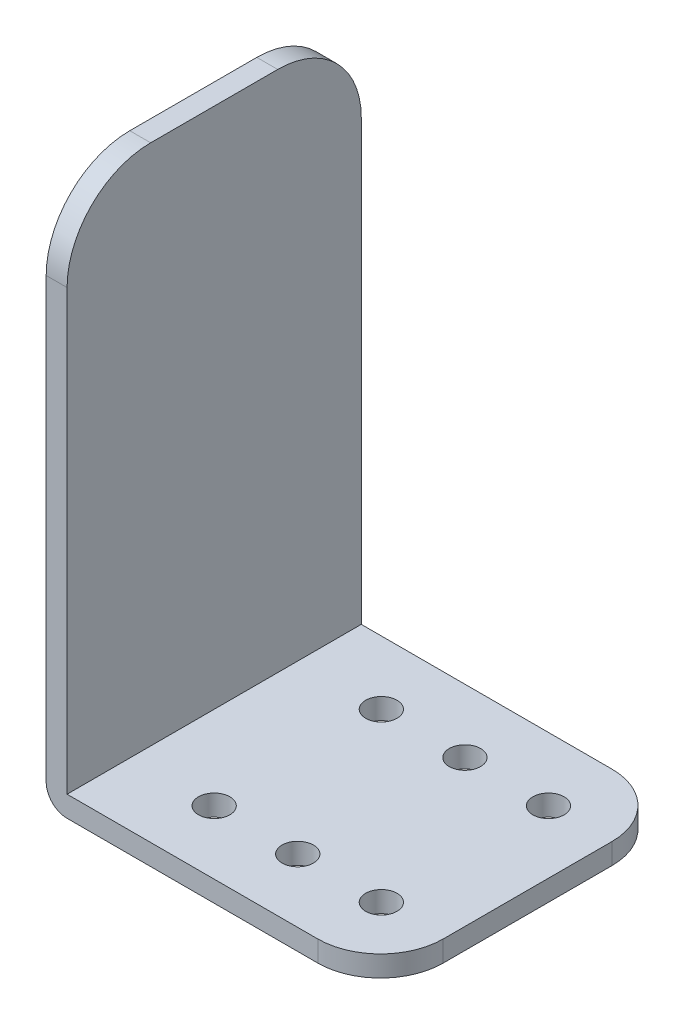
ISO-10303-21;
HEADER;
FILE_DESCRIPTION(('STEP AP214'),'2;1');
FILE_NAME('part.step','',(''),(''),'','','');
FILE_SCHEMA(('AUTOMOTIVE_DESIGN { 1 0 10303 214 1 1 1 1 }'));
ENDSEC;
DATA;
#1=APPLICATION_CONTEXT('core data for automotive mechanical design processes');
#2=APPLICATION_PROTOCOL_DEFINITION('international standard','automotive_design',2000,#1);
#3=PRODUCT_CONTEXT('',#1,'mechanical');
#4=PRODUCT('Part','Part','',(#3));
#5=PRODUCT_RELATED_PRODUCT_CATEGORY('part','',(#4));
#6=PRODUCT_DEFINITION_FORMATION('','',#4);
#7=PRODUCT_DEFINITION_CONTEXT('part definition',#1,'design');
#8=PRODUCT_DEFINITION('design','',#6,#7);
#9=PRODUCT_DEFINITION_SHAPE('','',#8);
#10=(LENGTH_UNIT() NAMED_UNIT(*) SI_UNIT(.MILLI.,.METRE.));
#11=(NAMED_UNIT(*) PLANE_ANGLE_UNIT() SI_UNIT($,.RADIAN.));
#12=(NAMED_UNIT(*) SI_UNIT($,.STERADIAN.) SOLID_ANGLE_UNIT());
#13=UNCERTAINTY_MEASURE_WITH_UNIT(LENGTH_MEASURE(1.E-05),#10,'distance_accuracy_value','');
#14=(GEOMETRIC_REPRESENTATION_CONTEXT(3) GLOBAL_UNCERTAINTY_ASSIGNED_CONTEXT((#13)) GLOBAL_UNIT_ASSIGNED_CONTEXT((#10,
#11,#12)) REPRESENTATION_CONTEXT('',''));
#15=CARTESIAN_POINT('',(0.,0.,0.));
#16=DIRECTION('',(0.,0.,1.));
#17=DIRECTION('',(1.,0.,0.));
#18=AXIS2_PLACEMENT_3D('',#15,#16,#17);
#19=CARTESIAN_POINT('',(0.,-82.55,171.45));
#20=DIRECTION('',(0.,1.,0.));
#21=DIRECTION('',(0.,0.,1.));
#22=AXIS2_PLACEMENT_3D('',#19,#20,#21);
#23=PLANE('',#22);
#24=CARTESIAN_POINT('',(41.275,-82.55,136.398));
#25=DIRECTION('',(0.,1.,0.));
#26=DIRECTION('',(0.,0.,1.));
#27=AXIS2_PLACEMENT_3D('',#24,#25,#26);
#28=CIRCLE('',#27,2.38125);
#29=CARTESIAN_POINT('',(41.275,-82.55,138.77925));
#30=VERTEX_POINT('',#29);
#31=EDGE_CURVE('E260',#30,#30,#28,.F.);
#32=ORIENTED_EDGE('',*,*,#31,.F.);
#33=EDGE_LOOP('',(#32));
#34=FACE_BOUND('',#33,.T.);
#35=CARTESIAN_POINT('',(28.575,-82.55,136.398));
#36=DIRECTION('',(0.,1.,0.));
#37=DIRECTION('',(0.,0.,1.));
#38=AXIS2_PLACEMENT_3D('',#35,#36,#37);
#39=CIRCLE('',#38,2.38125);
#40=CARTESIAN_POINT('',(28.575,-82.55,138.77925));
#41=VERTEX_POINT('',#40);
#42=EDGE_CURVE('E254',#41,#41,#39,.F.);
#43=ORIENTED_EDGE('',*,*,#42,.F.);
#44=EDGE_LOOP('',(#43));
#45=FACE_BOUND('',#44,.T.);
#46=CARTESIAN_POINT('',(15.875,-82.55,136.398));
#47=DIRECTION('',(0.,1.,0.));
#48=DIRECTION('',(0.,0.,1.));
#49=AXIS2_PLACEMENT_3D('',#46,#47,#48);
#50=CIRCLE('',#49,2.38125);
#51=CARTESIAN_POINT('',(15.875,-82.55,138.77925));
#52=VERTEX_POINT('',#51);
#53=EDGE_CURVE('E248',#52,#52,#50,.F.);
#54=ORIENTED_EDGE('',*,*,#53,.F.);
#55=EDGE_LOOP('',(#54));
#56=FACE_BOUND('',#55,.T.);
#57=CARTESIAN_POINT('',(41.275,-82.55,161.798));
#58=DIRECTION('',(0.,1.,0.));
#59=DIRECTION('',(0.,0.,1.));
#60=AXIS2_PLACEMENT_3D('',#57,#58,#59);
#61=CIRCLE('',#60,2.38125);
#62=CARTESIAN_POINT('',(41.275,-82.55,164.17925));
#63=VERTEX_POINT('',#62);
#64=EDGE_CURVE('E242',#63,#63,#61,.F.);
#65=ORIENTED_EDGE('',*,*,#64,.F.);
#66=EDGE_LOOP('',(#65));
#67=FACE_BOUND('',#66,.T.);
#68=CARTESIAN_POINT('',(28.575,-82.55,161.798));
#69=DIRECTION('',(0.,1.,0.));
#70=DIRECTION('',(0.,0.,1.));
#71=AXIS2_PLACEMENT_3D('',#68,#69,#70);
#72=CIRCLE('',#71,2.38125);
#73=CARTESIAN_POINT('',(28.575,-82.55,164.17925));
#74=VERTEX_POINT('',#73);
#75=EDGE_CURVE('E236',#74,#74,#72,.F.);
#76=ORIENTED_EDGE('',*,*,#75,.F.);
#77=EDGE_LOOP('',(#76));
#78=FACE_BOUND('',#77,.T.);
#79=CARTESIAN_POINT('',(15.875,-82.55,161.798));
#80=DIRECTION('',(0.,1.,0.));
#81=DIRECTION('',(0.,0.,1.));
#82=AXIS2_PLACEMENT_3D('',#79,#80,#81);
#83=CIRCLE('',#82,2.38125);
#84=CARTESIAN_POINT('',(15.875,-82.55,164.17925));
#85=VERTEX_POINT('',#84);
#86=EDGE_CURVE('E228',#85,#85,#83,.F.);
#87=ORIENTED_EDGE('',*,*,#86,.F.);
#88=EDGE_LOOP('',(#87));
#89=FACE_BOUND('',#88,.T.);
#90=DIRECTION('',(1.,0.,0.));
#91=VECTOR('',#90,1.);
#92=CARTESIAN_POINT('',(0.,-82.55,171.45));
#93=LINE('',#92,#91);
#94=CARTESIAN_POINT('',(3.17500000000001,-82.55,171.45));
#95=VERTEX_POINT('',#94);
#96=CARTESIAN_POINT('',(41.275,-82.55,171.45));
#97=VERTEX_POINT('',#96);
#98=EDGE_CURVE('E203',#95,#97,#93,.T.);
#99=ORIENTED_EDGE('',*,*,#98,.F.);
#100=DIRECTION('',(0.,0.,-1.));
#101=VECTOR('',#100,1.);
#102=CARTESIAN_POINT('',(3.17500000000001,-82.55,171.45));
#103=LINE('',#102,#101);
#104=CARTESIAN_POINT('',(3.17500000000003,-82.55,126.746));
#105=VERTEX_POINT('',#104);
#106=EDGE_CURVE('E172',#95,#105,#103,.T.);
#107=ORIENTED_EDGE('',*,*,#106,.T.);
#108=DIRECTION('',(-1.,0.,0.));
#109=VECTOR('',#108,1.);
#110=CARTESIAN_POINT('',(50.8,-82.55,126.746));
#111=LINE('',#110,#109);
#112=CARTESIAN_POINT('',(41.275,-82.55,126.746));
#113=VERTEX_POINT('',#112);
#114=EDGE_CURVE('E130',#113,#105,#111,.T.);
#115=ORIENTED_EDGE('',*,*,#114,.F.);
#116=CARTESIAN_POINT('',(41.275,-82.55,136.271));
#117=DIRECTION('',(0.,1.,0.));
#118=DIRECTION('',(0.,0.,1.));
#119=AXIS2_PLACEMENT_3D('',#116,#117,#118);
#120=CIRCLE('',#119,9.525);
#121=CARTESIAN_POINT('',(50.8,-82.55,136.271));
#122=VERTEX_POINT('',#121);
#123=EDGE_CURVE('E165',#113,#122,#120,.F.);
#124=ORIENTED_EDGE('',*,*,#123,.T.);
#125=DIRECTION('',(0.,0.,-1.));
#126=VECTOR('',#125,1.);
#127=CARTESIAN_POINT('',(50.8,-82.55,171.45));
#128=LINE('',#127,#126);
#129=CARTESIAN_POINT('',(50.8,-82.55,161.925));
#130=VERTEX_POINT('',#129);
#131=EDGE_CURVE('E147',#130,#122,#128,.T.);
#132=ORIENTED_EDGE('',*,*,#131,.F.);
#133=CARTESIAN_POINT('',(41.275,-82.55,161.925));
#134=DIRECTION('',(0.,1.,0.));
#135=DIRECTION('',(0.,0.,1.));
#136=AXIS2_PLACEMENT_3D('',#133,#134,#135);
#137=CIRCLE('',#136,9.525);
#138=EDGE_CURVE('E167',#130,#97,#137,.F.);
#139=ORIENTED_EDGE('',*,*,#138,.T.);
#140=EDGE_LOOP('',(#99,#107,#115,#124,#132,#139));
#141=FACE_BOUND('',#140,.T.);
#142=ADVANCED_FACE('F35',(#34,#45,#56,#67,#78,#89,#141),#23,.F.);
#143=CARTESIAN_POINT('',(50.8,-82.55,171.45));
#144=DIRECTION('',(-1.,0.,0.));
#145=DIRECTION('',(0.,0.,1.));
#146=AXIS2_PLACEMENT_3D('',#143,#144,#145);
#147=PLANE('',#146);
#148=DIRECTION('',(0.,0.,-1.));
#149=VECTOR('',#148,1.);
#150=CARTESIAN_POINT('',(50.8,-79.375,171.45));
#151=LINE('',#150,#149);
#152=CARTESIAN_POINT('',(50.8,-79.375,161.925));
#153=VERTEX_POINT('',#152);
#154=CARTESIAN_POINT('',(50.8,-79.375,136.271));
#155=VERTEX_POINT('',#154);
#156=EDGE_CURVE('E144',#153,#155,#151,.T.);
#157=ORIENTED_EDGE('',*,*,#156,.F.);
#158=DIRECTION('',(0.,1.,0.));
#159=VECTOR('',#158,1.);
#160=CARTESIAN_POINT('',(50.8,-82.55,161.925));
#161=LINE('',#160,#159);
#162=EDGE_CURVE('E163',#153,#130,#161,.F.);
#163=ORIENTED_EDGE('',*,*,#162,.T.);
#164=ORIENTED_EDGE('',*,*,#131,.T.);
#165=DIRECTION('',(0.,1.,0.));
#166=VECTOR('',#165,1.);
#167=CARTESIAN_POINT('',(50.8,-82.55,136.271));
#168=LINE('',#167,#166);
#169=EDGE_CURVE('E160',#122,#155,#168,.T.);
#170=ORIENTED_EDGE('',*,*,#169,.T.);
#171=EDGE_LOOP('',(#157,#163,#164,#170));
#172=FACE_BOUND('',#171,.T.);
#173=ADVANCED_FACE('F214',(#172),#147,.F.);
#174=CARTESIAN_POINT('',(3.17500000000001,-79.375,171.45));
#175=DIRECTION('',(0.,-1.,0.));
#176=DIRECTION('',(0.,0.,-1.));
#177=AXIS2_PLACEMENT_3D('',#174,#175,#176);
#178=PLANE('',#177);
#179=CARTESIAN_POINT('',(41.275,-79.375,136.398));
#180=DIRECTION('',(0.,1.,0.));
#181=DIRECTION('',(0.,0.,1.));
#182=AXIS2_PLACEMENT_3D('',#179,#180,#181);
#183=CIRCLE('',#182,2.38125);
#184=CARTESIAN_POINT('',(41.275,-79.375,138.77925));
#185=VERTEX_POINT('',#184);
#186=EDGE_CURVE('E263',#185,#185,#183,.T.);
#187=ORIENTED_EDGE('',*,*,#186,.F.);
#188=EDGE_LOOP('',(#187));
#189=FACE_BOUND('',#188,.T.);
#190=CARTESIAN_POINT('',(28.575,-79.375,136.398));
#191=DIRECTION('',(0.,1.,0.));
#192=DIRECTION('',(0.,0.,1.));
#193=AXIS2_PLACEMENT_3D('',#190,#191,#192);
#194=CIRCLE('',#193,2.38125);
#195=CARTESIAN_POINT('',(28.575,-79.375,138.77925));
#196=VERTEX_POINT('',#195);
#197=EDGE_CURVE('E257',#196,#196,#194,.T.);
#198=ORIENTED_EDGE('',*,*,#197,.F.);
#199=EDGE_LOOP('',(#198));
#200=FACE_BOUND('',#199,.T.);
#201=CARTESIAN_POINT('',(15.875,-79.375,136.398));
#202=DIRECTION('',(0.,1.,0.));
#203=DIRECTION('',(0.,0.,1.));
#204=AXIS2_PLACEMENT_3D('',#201,#202,#203);
#205=CIRCLE('',#204,2.38125);
#206=CARTESIAN_POINT('',(15.875,-79.375,138.77925));
#207=VERTEX_POINT('',#206);
#208=EDGE_CURVE('E251',#207,#207,#205,.T.);
#209=ORIENTED_EDGE('',*,*,#208,.F.);
#210=EDGE_LOOP('',(#209));
#211=FACE_BOUND('',#210,.T.);
#212=CARTESIAN_POINT('',(41.275,-79.375,161.798));
#213=DIRECTION('',(0.,1.,0.));
#214=DIRECTION('',(0.,0.,1.));
#215=AXIS2_PLACEMENT_3D('',#212,#213,#214);
#216=CIRCLE('',#215,2.38125);
#217=CARTESIAN_POINT('',(41.275,-79.375,164.17925));
#218=VERTEX_POINT('',#217);
#219=EDGE_CURVE('E245',#218,#218,#216,.T.);
#220=ORIENTED_EDGE('',*,*,#219,.F.);
#221=EDGE_LOOP('',(#220));
#222=FACE_BOUND('',#221,.T.);
#223=CARTESIAN_POINT('',(28.575,-79.375,161.798));
#224=DIRECTION('',(0.,1.,0.));
#225=DIRECTION('',(0.,0.,1.));
#226=AXIS2_PLACEMENT_3D('',#223,#224,#225);
#227=CIRCLE('',#226,2.38125);
#228=CARTESIAN_POINT('',(28.575,-79.375,164.17925));
#229=VERTEX_POINT('',#228);
#230=EDGE_CURVE('E239',#229,#229,#227,.T.);
#231=ORIENTED_EDGE('',*,*,#230,.F.);
#232=EDGE_LOOP('',(#231));
#233=FACE_BOUND('',#232,.T.);
#234=CARTESIAN_POINT('',(15.875,-79.375,161.798));
#235=DIRECTION('',(0.,1.,0.));
#236=DIRECTION('',(0.,0.,1.));
#237=AXIS2_PLACEMENT_3D('',#234,#235,#236);
#238=CIRCLE('',#237,2.38125);
#239=CARTESIAN_POINT('',(15.875,-79.375,164.17925));
#240=VERTEX_POINT('',#239);
#241=EDGE_CURVE('E233',#240,#240,#238,.T.);
#242=ORIENTED_EDGE('',*,*,#241,.F.);
#243=EDGE_LOOP('',(#242));
#244=FACE_BOUND('',#243,.T.);
#245=DIRECTION('',(-1.,0.,0.));
#246=VECTOR('',#245,1.);
#247=CARTESIAN_POINT('',(3.17500000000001,-79.375,171.45));
#248=LINE('',#247,#246);
#249=CARTESIAN_POINT('',(41.275,-79.375,171.45));
#250=VERTEX_POINT('',#249);
#251=CARTESIAN_POINT('',(3.17500000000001,-79.375,171.45));
#252=VERTEX_POINT('',#251);
#253=EDGE_CURVE('E205',#250,#252,#248,.T.);
#254=ORIENTED_EDGE('',*,*,#253,.F.);
#255=CARTESIAN_POINT('',(41.275,-79.375,161.925));
#256=DIRECTION('',(0.,-1.,0.));
#257=DIRECTION('',(0.,0.,-1.));
#258=AXIS2_PLACEMENT_3D('',#255,#256,#257);
#259=CIRCLE('',#258,9.525);
#260=EDGE_CURVE('E158',#250,#153,#259,.F.);
#261=ORIENTED_EDGE('',*,*,#260,.T.);
#262=ORIENTED_EDGE('',*,*,#156,.T.);
#263=CARTESIAN_POINT('',(41.275,-79.375,136.271));
#264=DIRECTION('',(0.,-1.,0.));
#265=DIRECTION('',(0.,0.,-1.));
#266=AXIS2_PLACEMENT_3D('',#263,#264,#265);
#267=CIRCLE('',#266,9.525);
#268=CARTESIAN_POINT('',(41.275,-79.375,126.746));
#269=VERTEX_POINT('',#268);
#270=EDGE_CURVE('E126',#155,#269,#267,.F.);
#271=ORIENTED_EDGE('',*,*,#270,.T.);
#272=DIRECTION('',(-1.,0.,0.));
#273=VECTOR('',#272,1.);
#274=CARTESIAN_POINT('',(3.17500000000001,-79.375,126.746));
#275=LINE('',#274,#273);
#276=CARTESIAN_POINT('',(3.17500000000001,-79.375,126.746));
#277=VERTEX_POINT('',#276);
#278=EDGE_CURVE('E118',#269,#277,#275,.T.);
#279=ORIENTED_EDGE('',*,*,#278,.T.);
#280=DIRECTION('',(0.,0.,-1.));
#281=VECTOR('',#280,1.);
#282=CARTESIAN_POINT('',(3.17500000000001,-79.375,171.45));
#283=LINE('',#282,#281);
#284=EDGE_CURVE('E123',#252,#277,#283,.T.);
#285=ORIENTED_EDGE('',*,*,#284,.F.);
#286=EDGE_LOOP('',(#254,#261,#262,#271,#279,#285));
#287=FACE_BOUND('',#286,.T.);
#288=ADVANCED_FACE('F121',(#189,#200,#211,#222,#233,#244,#287),#178,.F.);
#289=CARTESIAN_POINT('',(0.,0.,171.45));
#290=DIRECTION('',(0.,-1.,0.));
#291=DIRECTION('',(0.,0.,-1.));
#292=AXIS2_PLACEMENT_3D('',#289,#290,#291);
#293=PLANE('',#292);
#294=DIRECTION('',(0.,0.,-1.));
#295=VECTOR('',#294,1.);
#296=CARTESIAN_POINT('',(3.175,0.,171.45));
#297=LINE('',#296,#295);
#298=CARTESIAN_POINT('',(3.175,0.,158.75));
#299=VERTEX_POINT('',#298);
#300=CARTESIAN_POINT('',(3.175,0.,139.446));
#301=VERTEX_POINT('',#300);
#302=EDGE_CURVE('E145',#299,#301,#297,.T.);
#303=ORIENTED_EDGE('',*,*,#302,.T.);
#304=DIRECTION('',(1.,0.,0.));
#305=VECTOR('',#304,1.);
#306=CARTESIAN_POINT('',(0.,0.,139.446));
#307=LINE('',#306,#305);
#308=CARTESIAN_POINT('',(0.,0.,139.446));
#309=VERTEX_POINT('',#308);
#310=EDGE_CURVE('E43',#301,#309,#307,.F.);
#311=ORIENTED_EDGE('',*,*,#310,.T.);
#312=DIRECTION('',(0.,0.,-1.));
#313=VECTOR('',#312,1.);
#314=CARTESIAN_POINT('',(0.,0.,171.45));
#315=LINE('',#314,#313);
#316=CARTESIAN_POINT('',(0.,0.,158.75));
#317=VERTEX_POINT('',#316);
#318=EDGE_CURVE('E139',#317,#309,#315,.T.);
#319=ORIENTED_EDGE('',*,*,#318,.F.);
#320=DIRECTION('',(-1.,0.,0.));
#321=VECTOR('',#320,1.);
#322=CARTESIAN_POINT('',(0.,0.,158.75));
#323=LINE('',#322,#321);
#324=EDGE_CURVE('E182',#317,#299,#323,.F.);
#325=ORIENTED_EDGE('',*,*,#324,.T.);
#326=EDGE_LOOP('',(#303,#311,#319,#325));
#327=FACE_BOUND('',#326,.T.);
#328=ADVANCED_FACE('F272',(#327),#293,.F.);
#329=CARTESIAN_POINT('',(0.,0.,171.45));
#330=DIRECTION('',(1.,0.,0.));
#331=DIRECTION('',(0.,1.,0.));
#332=AXIS2_PLACEMENT_3D('',#329,#330,#331);
#333=PLANE('',#332);
#334=ORIENTED_EDGE('',*,*,#318,.T.);
#335=CARTESIAN_POINT('',(0.,-12.7,139.446));
#336=DIRECTION('',(1.,0.,0.));
#337=DIRECTION('',(0.,1.,0.));
#338=AXIS2_PLACEMENT_3D('',#335,#336,#337);
#339=CIRCLE('',#338,12.7);
#340=CARTESIAN_POINT('',(0.,-12.7,126.746));
#341=VERTEX_POINT('',#340);
#342=EDGE_CURVE('E11',#309,#341,#339,.F.);
#343=ORIENTED_EDGE('',*,*,#342,.T.);
#344=DIRECTION('',(0.,1.,0.));
#345=VECTOR('',#344,1.);
#346=CARTESIAN_POINT('',(0.,-82.55,126.746));
#347=LINE('',#346,#345);
#348=CARTESIAN_POINT('',(0.,-79.375,126.746));
#349=VERTEX_POINT('',#348);
#350=EDGE_CURVE('E227',#349,#341,#347,.T.);
#351=ORIENTED_EDGE('',*,*,#350,.F.);
#352=DIRECTION('',(0.,0.,-1.));
#353=VECTOR('',#352,1.);
#354=CARTESIAN_POINT('',(0.,-79.375,171.45));
#355=LINE('',#354,#353);
#356=CARTESIAN_POINT('',(0.,-79.375,171.45));
#357=VERTEX_POINT('',#356);
#358=EDGE_CURVE('E177',#349,#357,#355,.F.);
#359=ORIENTED_EDGE('',*,*,#358,.T.);
#360=DIRECTION('',(0.,-1.,0.));
#361=VECTOR('',#360,1.);
#362=CARTESIAN_POINT('',(0.,0.,171.45));
#363=LINE('',#362,#361);
#364=CARTESIAN_POINT('',(0.,-12.7,171.45));
#365=VERTEX_POINT('',#364);
#366=EDGE_CURVE('E129',#365,#357,#363,.T.);
#367=ORIENTED_EDGE('',*,*,#366,.F.);
#368=CARTESIAN_POINT('',(0.,-12.7,158.75));
#369=DIRECTION('',(1.,0.,0.));
#370=DIRECTION('',(0.,1.,0.));
#371=AXIS2_PLACEMENT_3D('',#368,#369,#370);
#372=CIRCLE('',#371,12.7);
#373=EDGE_CURVE('E184',#365,#317,#372,.F.);
#374=ORIENTED_EDGE('',*,*,#373,.T.);
#375=EDGE_LOOP('',(#334,#343,#351,#359,#367,#374));
#376=FACE_BOUND('',#375,.T.);
#377=ADVANCED_FACE('F199',(#376),#333,.F.);
#378=CARTESIAN_POINT('',(3.175,0.,171.45));
#379=DIRECTION('',(-1.,0.,0.));
#380=DIRECTION('',(0.,-1.,0.));
#381=AXIS2_PLACEMENT_3D('',#378,#379,#380);
#382=PLANE('',#381);
#383=DIRECTION('',(0.,1.,0.));
#384=VECTOR('',#383,1.);
#385=CARTESIAN_POINT('',(3.175,0.,126.746));
#386=LINE('',#385,#384);
#387=CARTESIAN_POINT('',(3.175,-12.7,126.746));
#388=VERTEX_POINT('',#387);
#389=EDGE_CURVE('E133',#277,#388,#386,.T.);
#390=ORIENTED_EDGE('',*,*,#389,.T.);
#391=CARTESIAN_POINT('',(3.175,-12.7,139.446));
#392=DIRECTION('',(-1.,0.,0.));
#393=DIRECTION('',(0.,-1.,0.));
#394=AXIS2_PLACEMENT_3D('',#391,#392,#393);
#395=CIRCLE('',#394,12.7);
#396=EDGE_CURVE('E57',#388,#301,#395,.F.);
#397=ORIENTED_EDGE('',*,*,#396,.T.);
#398=ORIENTED_EDGE('',*,*,#302,.F.);
#399=CARTESIAN_POINT('',(3.175,-12.7,158.75));
#400=DIRECTION('',(-1.,0.,0.));
#401=DIRECTION('',(0.,-1.,0.));
#402=AXIS2_PLACEMENT_3D('',#399,#400,#401);
#403=CIRCLE('',#402,12.7);
#404=CARTESIAN_POINT('',(3.175,-12.7,171.45));
#405=VERTEX_POINT('',#404);
#406=EDGE_CURVE('E186',#299,#405,#403,.F.);
#407=ORIENTED_EDGE('',*,*,#406,.T.);
#408=DIRECTION('',(0.,1.,0.));
#409=VECTOR('',#408,1.);
#410=CARTESIAN_POINT('',(3.175,0.,171.45));
#411=LINE('',#410,#409);
#412=EDGE_CURVE('E143',#252,#405,#411,.T.);
#413=ORIENTED_EDGE('',*,*,#412,.F.);
#414=ORIENTED_EDGE('',*,*,#284,.T.);
#415=EDGE_LOOP('',(#390,#397,#398,#407,#413,#414));
#416=FACE_BOUND('',#415,.T.);
#417=ADVANCED_FACE('F141',(#416),#382,.F.);
#418=CARTESIAN_POINT('',(0.,0.,171.45));
#419=DIRECTION('',(0.,0.,-1.));
#420=DIRECTION('',(-1.,0.,0.));
#421=AXIS2_PLACEMENT_3D('',#418,#419,#420);
#422=PLANE('',#421);
#423=ORIENTED_EDGE('',*,*,#412,.T.);
#424=DIRECTION('',(-1.,0.,0.));
#425=VECTOR('',#424,1.);
#426=CARTESIAN_POINT('',(0.,-12.7,171.45));
#427=LINE('',#426,#425);
#428=EDGE_CURVE('E188',#405,#365,#427,.T.);
#429=ORIENTED_EDGE('',*,*,#428,.T.);
#430=ORIENTED_EDGE('',*,*,#366,.T.);
#431=CARTESIAN_POINT('',(3.17500000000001,-79.375,171.45));
#432=DIRECTION('',(0.,0.,-1.));
#433=DIRECTION('',(-1.,0.,0.));
#434=AXIS2_PLACEMENT_3D('',#431,#432,#433);
#435=CIRCLE('',#434,3.175);
#436=EDGE_CURVE('E180',#357,#95,#435,.F.);
#437=ORIENTED_EDGE('',*,*,#436,.T.);
#438=ORIENTED_EDGE('',*,*,#98,.T.);
#439=DIRECTION('',(0.,1.,0.));
#440=VECTOR('',#439,1.);
#441=CARTESIAN_POINT('',(41.275,0.,171.45));
#442=LINE('',#441,#440);
#443=EDGE_CURVE('E138',#97,#250,#442,.T.);
#444=ORIENTED_EDGE('',*,*,#443,.T.);
#445=ORIENTED_EDGE('',*,*,#253,.T.);
#446=EDGE_LOOP('',(#423,#429,#430,#437,#438,#444,#445));
#447=FACE_BOUND('',#446,.T.);
#448=ADVANCED_FACE('F195',(#447),#422,.F.);
#449=CARTESIAN_POINT('',(50.8,-82.55,126.746));
#450=DIRECTION('',(0.,0.,1.));
#451=DIRECTION('',(1.,0.,0.));
#452=AXIS2_PLACEMENT_3D('',#449,#450,#451);
#453=PLANE('',#452);
#454=ORIENTED_EDGE('',*,*,#350,.T.);
#455=DIRECTION('',(1.,0.,0.));
#456=VECTOR('',#455,1.);
#457=CARTESIAN_POINT('',(50.8,-12.7,126.746));
#458=LINE('',#457,#456);
#459=EDGE_CURVE('E137',#341,#388,#458,.T.);
#460=ORIENTED_EDGE('',*,*,#459,.T.);
#461=ORIENTED_EDGE('',*,*,#389,.F.);
#462=ORIENTED_EDGE('',*,*,#278,.F.);
#463=DIRECTION('',(0.,1.,0.));
#464=VECTOR('',#463,1.);
#465=CARTESIAN_POINT('',(41.275,-82.55,126.746));
#466=LINE('',#465,#464);
#467=EDGE_CURVE('E170',#269,#113,#466,.F.);
#468=ORIENTED_EDGE('',*,*,#467,.T.);
#469=ORIENTED_EDGE('',*,*,#114,.T.);
#470=CARTESIAN_POINT('',(3.17500000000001,-79.375,126.746));
#471=DIRECTION('',(0.,0.,1.));
#472=DIRECTION('',(1.,0.,0.));
#473=AXIS2_PLACEMENT_3D('',#470,#471,#472);
#474=CIRCLE('',#473,3.175);
#475=EDGE_CURVE('E175',#105,#349,#474,.F.);
#476=ORIENTED_EDGE('',*,*,#475,.T.);
#477=EDGE_LOOP('',(#454,#460,#461,#462,#468,#469,#476));
#478=FACE_BOUND('',#477,.T.);
#479=ADVANCED_FACE('F135',(#478),#453,.F.);
#480=CARTESIAN_POINT('',(15.875,-82.551,161.798));
#481=DIRECTION('',(0.,1.,0.));
#482=DIRECTION('',(0.,0.,1.));
#483=AXIS2_PLACEMENT_3D('',#480,#481,#482);
#484=CYLINDRICAL_SURFACE('',#483,2.38125);
#485=ORIENTED_EDGE('',*,*,#241,.T.);
#486=EDGE_LOOP('',(#485));
#487=FACE_BOUND('',#486,.T.);
#488=ORIENTED_EDGE('',*,*,#86,.T.);
#489=EDGE_LOOP('',(#488));
#490=FACE_BOUND('',#489,.T.);
#491=ADVANCED_FACE('F284',(#487,#490),#484,.F.);
#492=CARTESIAN_POINT('',(28.575,-82.551,161.798));
#493=DIRECTION('',(0.,1.,0.));
#494=DIRECTION('',(0.,0.,1.));
#495=AXIS2_PLACEMENT_3D('',#492,#493,#494);
#496=CYLINDRICAL_SURFACE('',#495,2.38125);
#497=ORIENTED_EDGE('',*,*,#230,.T.);
#498=EDGE_LOOP('',(#497));
#499=FACE_BOUND('',#498,.T.);
#500=ORIENTED_EDGE('',*,*,#75,.T.);
#501=EDGE_LOOP('',(#500));
#502=FACE_BOUND('',#501,.T.);
#503=ADVANCED_FACE('F287',(#499,#502),#496,.F.);
#504=CARTESIAN_POINT('',(41.275,-82.551,161.798));
#505=DIRECTION('',(0.,1.,0.));
#506=DIRECTION('',(0.,0.,1.));
#507=AXIS2_PLACEMENT_3D('',#504,#505,#506);
#508=CYLINDRICAL_SURFACE('',#507,2.38125);
#509=ORIENTED_EDGE('',*,*,#219,.T.);
#510=EDGE_LOOP('',(#509));
#511=FACE_BOUND('',#510,.T.);
#512=ORIENTED_EDGE('',*,*,#64,.T.);
#513=EDGE_LOOP('',(#512));
#514=FACE_BOUND('',#513,.T.);
#515=ADVANCED_FACE('F425',(#511,#514),#508,.F.);
#516=CARTESIAN_POINT('',(15.875,-82.551,136.398));
#517=DIRECTION('',(0.,1.,0.));
#518=DIRECTION('',(0.,0.,1.));
#519=AXIS2_PLACEMENT_3D('',#516,#517,#518);
#520=CYLINDRICAL_SURFACE('',#519,2.38125);
#521=ORIENTED_EDGE('',*,*,#208,.T.);
#522=EDGE_LOOP('',(#521));
#523=FACE_BOUND('',#522,.T.);
#524=ORIENTED_EDGE('',*,*,#53,.T.);
#525=EDGE_LOOP('',(#524));
#526=FACE_BOUND('',#525,.T.);
#527=ADVANCED_FACE('F415',(#523,#526),#520,.F.);
#528=CARTESIAN_POINT('',(28.575,-82.551,136.398));
#529=DIRECTION('',(0.,1.,0.));
#530=DIRECTION('',(0.,0.,1.));
#531=AXIS2_PLACEMENT_3D('',#528,#529,#530);
#532=CYLINDRICAL_SURFACE('',#531,2.38125);
#533=ORIENTED_EDGE('',*,*,#197,.T.);
#534=EDGE_LOOP('',(#533));
#535=FACE_BOUND('',#534,.T.);
#536=ORIENTED_EDGE('',*,*,#42,.T.);
#537=EDGE_LOOP('',(#536));
#538=FACE_BOUND('',#537,.T.);
#539=ADVANCED_FACE('F406',(#535,#538),#532,.F.);
#540=CARTESIAN_POINT('',(41.275,-82.551,136.398));
#541=DIRECTION('',(0.,1.,0.));
#542=DIRECTION('',(0.,0.,1.));
#543=AXIS2_PLACEMENT_3D('',#540,#541,#542);
#544=CYLINDRICAL_SURFACE('',#543,2.38125);
#545=ORIENTED_EDGE('',*,*,#186,.T.);
#546=EDGE_LOOP('',(#545));
#547=FACE_BOUND('',#546,.T.);
#548=ORIENTED_EDGE('',*,*,#31,.T.);
#549=EDGE_LOOP('',(#548));
#550=FACE_BOUND('',#549,.T.);
#551=ADVANCED_FACE('F267',(#547,#550),#544,.F.);
#552=CARTESIAN_POINT('',(41.275,0.,161.925));
#553=DIRECTION('',(0.,1.,0.));
#554=DIRECTION('',(0.,0.,1.));
#555=AXIS2_PLACEMENT_3D('',#552,#553,#554);
#556=CYLINDRICAL_SURFACE('',#555,9.525);
#557=ORIENTED_EDGE('',*,*,#138,.F.);
#558=ORIENTED_EDGE('',*,*,#162,.F.);
#559=ORIENTED_EDGE('',*,*,#260,.F.);
#560=ORIENTED_EDGE('',*,*,#443,.F.);
#561=EDGE_LOOP('',(#557,#558,#559,#560));
#562=FACE_BOUND('',#561,.T.);
#563=ADVANCED_FACE('F218',(#562),#556,.T.);
#564=CARTESIAN_POINT('',(41.275,-82.55,136.271));
#565=DIRECTION('',(0.,1.,0.));
#566=DIRECTION('',(0.,0.,1.));
#567=AXIS2_PLACEMENT_3D('',#564,#565,#566);
#568=CYLINDRICAL_SURFACE('',#567,9.525);
#569=ORIENTED_EDGE('',*,*,#123,.F.);
#570=ORIENTED_EDGE('',*,*,#467,.F.);
#571=ORIENTED_EDGE('',*,*,#270,.F.);
#572=ORIENTED_EDGE('',*,*,#169,.F.);
#573=EDGE_LOOP('',(#569,#570,#571,#572));
#574=FACE_BOUND('',#573,.T.);
#575=ADVANCED_FACE('F225',(#574),#568,.T.);
#576=CARTESIAN_POINT('',(3.17500000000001,-79.375,171.45));
#577=DIRECTION('',(0.,0.,-1.));
#578=DIRECTION('',(-1.,0.,0.));
#579=AXIS2_PLACEMENT_3D('',#576,#577,#578);
#580=CYLINDRICAL_SURFACE('',#579,3.175);
#581=ORIENTED_EDGE('',*,*,#436,.F.);
#582=ORIENTED_EDGE('',*,*,#358,.F.);
#583=ORIENTED_EDGE('',*,*,#475,.F.);
#584=ORIENTED_EDGE('',*,*,#106,.F.);
#585=EDGE_LOOP('',(#581,#582,#583,#584));
#586=FACE_BOUND('',#585,.T.);
#587=ADVANCED_FACE('F309',(#586),#580,.T.);
#588=CARTESIAN_POINT('',(0.,-12.7,158.75));
#589=DIRECTION('',(-1.,0.,0.));
#590=DIRECTION('',(0.,0.,1.));
#591=AXIS2_PLACEMENT_3D('',#588,#589,#590);
#592=CYLINDRICAL_SURFACE('',#591,12.7);
#593=ORIENTED_EDGE('',*,*,#406,.F.);
#594=ORIENTED_EDGE('',*,*,#324,.F.);
#595=ORIENTED_EDGE('',*,*,#373,.F.);
#596=ORIENTED_EDGE('',*,*,#428,.F.);
#597=EDGE_LOOP('',(#593,#594,#595,#596));
#598=FACE_BOUND('',#597,.T.);
#599=ADVANCED_FACE('F311',(#598),#592,.T.);
#600=CARTESIAN_POINT('',(50.8,-12.7,139.446));
#601=DIRECTION('',(1.,0.,0.));
#602=DIRECTION('',(0.,0.,-1.));
#603=AXIS2_PLACEMENT_3D('',#600,#601,#602);
#604=CYLINDRICAL_SURFACE('',#603,12.7);
#605=ORIENTED_EDGE('',*,*,#342,.F.);
#606=ORIENTED_EDGE('',*,*,#310,.F.);
#607=ORIENTED_EDGE('',*,*,#396,.F.);
#608=ORIENTED_EDGE('',*,*,#459,.F.);
#609=EDGE_LOOP('',(#605,#606,#607,#608));
#610=FACE_BOUND('',#609,.T.);
#611=ADVANCED_FACE('F37',(#610),#604,.T.);
#612=CLOSED_SHELL('',(#142,#173,#288,#328,#377,#417,#448,#479,#491,#503,#515,#527,#539,#551,
#563,#575,#587,#599,#611));
#613=MANIFOLD_SOLID_BREP('B2',#612);
#614=ADVANCED_BREP_SHAPE_REPRESENTATION('',(#18,#613),#14);
#615=SHAPE_DEFINITION_REPRESENTATION(#9,#614);
ENDSEC;
END-ISO-10303-21;
